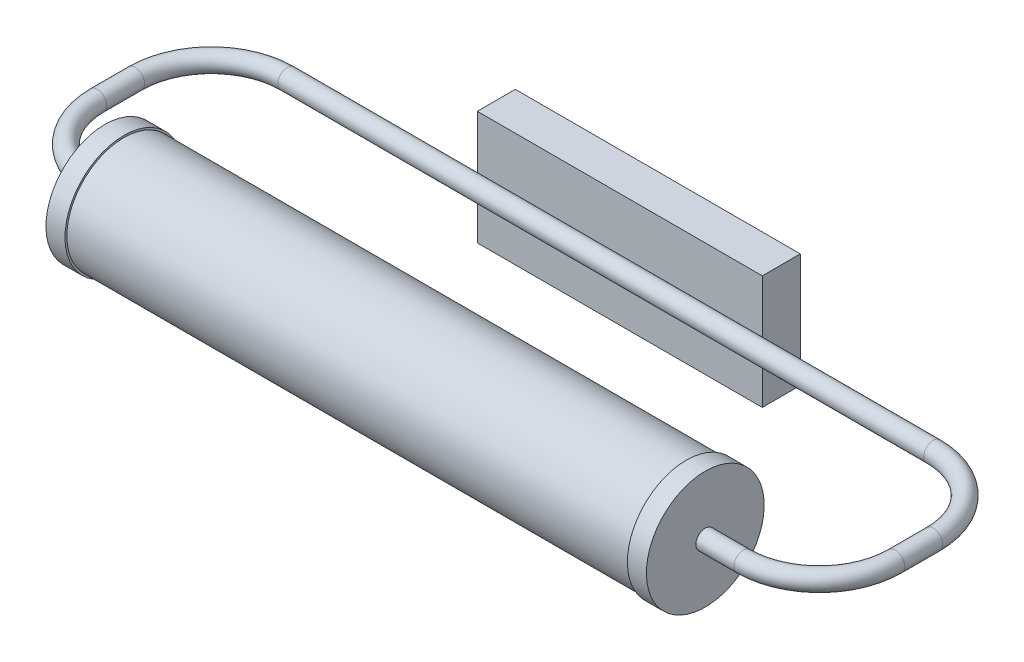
ISO-10303-21;
HEADER;
FILE_DESCRIPTION(('STEP AP214'),'2;1');
FILE_NAME('part.step','',(''),(''),'','','');
FILE_SCHEMA(('AUTOMOTIVE_DESIGN { 1 0 10303 214 1 1 1 1 }'));
ENDSEC;
DATA;
#1=APPLICATION_CONTEXT('core data for automotive mechanical design processes');
#2=APPLICATION_PROTOCOL_DEFINITION('international standard','automotive_design',2000,#1);
#3=PRODUCT_CONTEXT('',#1,'mechanical');
#4=PRODUCT('Part','Part','',(#3));
#5=PRODUCT_RELATED_PRODUCT_CATEGORY('part','',(#4));
#6=PRODUCT_DEFINITION_FORMATION('','',#4);
#7=PRODUCT_DEFINITION_CONTEXT('part definition',#1,'design');
#8=PRODUCT_DEFINITION('design','',#6,#7);
#9=PRODUCT_DEFINITION_SHAPE('','',#8);
#10=(LENGTH_UNIT() NAMED_UNIT(*) SI_UNIT(.MILLI.,.METRE.));
#11=(NAMED_UNIT(*) PLANE_ANGLE_UNIT() SI_UNIT($,.RADIAN.));
#12=(NAMED_UNIT(*) SI_UNIT($,.STERADIAN.) SOLID_ANGLE_UNIT());
#13=UNCERTAINTY_MEASURE_WITH_UNIT(LENGTH_MEASURE(1.E-05),#10,'distance_accuracy_value','');
#14=(GEOMETRIC_REPRESENTATION_CONTEXT(3) GLOBAL_UNCERTAINTY_ASSIGNED_CONTEXT((#13)) GLOBAL_UNIT_ASSIGNED_CONTEXT((#10,
#11,#12)) REPRESENTATION_CONTEXT('',''));
#15=CARTESIAN_POINT('',(0.,0.,0.));
#16=DIRECTION('',(0.,0.,1.));
#17=DIRECTION('',(1.,0.,0.));
#18=AXIS2_PLACEMENT_3D('',#15,#16,#17);
#19=CARTESIAN_POINT('',(-31.,30.,-125.));
#20=DIRECTION('',(1.,0.,0.));
#21=DIRECTION('',(0.,0.,-1.));
#22=AXIS2_PLACEMENT_3D('',#19,#20,#21);
#23=PLANE('',#22);
#24=DIRECTION('',(0.,1.,0.));
#25=VECTOR('',#24,1.);
#26=CARTESIAN_POINT('',(-31.,30.,-105.));
#27=LINE('',#26,#25);
#28=CARTESIAN_POINT('',(-31.,-30.,-105.));
#29=VERTEX_POINT('',#28);
#30=CARTESIAN_POINT('',(-31.,30.,-105.));
#31=VERTEX_POINT('',#30);
#32=EDGE_CURVE('E183',#29,#31,#27,.T.);
#33=ORIENTED_EDGE('',*,*,#32,.T.);
#34=DIRECTION('',(0.,0.,1.));
#35=VECTOR('',#34,1.);
#36=CARTESIAN_POINT('',(-31.,30.,-125.));
#37=LINE('',#36,#35);
#38=CARTESIAN_POINT('',(-31.,30.,-125.));
#39=VERTEX_POINT('',#38);
#40=EDGE_CURVE('E13',#39,#31,#37,.T.);
#41=ORIENTED_EDGE('',*,*,#40,.F.);
#42=DIRECTION('',(0.,1.,0.));
#43=VECTOR('',#42,1.);
#44=CARTESIAN_POINT('',(-31.,30.,-125.));
#45=LINE('',#44,#43);
#46=CARTESIAN_POINT('',(-31.,-30.,-125.));
#47=VERTEX_POINT('',#46);
#48=EDGE_CURVE('E176',#47,#39,#45,.T.);
#49=ORIENTED_EDGE('',*,*,#48,.F.);
#50=DIRECTION('',(0.,0.,1.));
#51=VECTOR('',#50,1.);
#52=CARTESIAN_POINT('',(-31.,-30.,-125.));
#53=LINE('',#52,#51);
#54=EDGE_CURVE('E182',#47,#29,#53,.T.);
#55=ORIENTED_EDGE('',*,*,#54,.T.);
#56=EDGE_LOOP('',(#33,#41,#49,#55));
#57=FACE_BOUND('',#56,.T.);
#58=ADVANCED_FACE('F69',(#57),#23,.F.);
#59=CARTESIAN_POINT('',(119.,30.,-125.));
#60=DIRECTION('',(0.,-1.,0.));
#61=DIRECTION('',(0.,0.,-1.));
#62=AXIS2_PLACEMENT_3D('',#59,#60,#61);
#63=PLANE('',#62);
#64=DIRECTION('',(1.,0.,0.));
#65=VECTOR('',#64,1.);
#66=CARTESIAN_POINT('',(119.,30.,-105.));
#67=LINE('',#66,#65);
#68=CARTESIAN_POINT('',(119.,30.,-105.));
#69=VERTEX_POINT('',#68);
#70=EDGE_CURVE('E186',#31,#69,#67,.T.);
#71=ORIENTED_EDGE('',*,*,#70,.T.);
#72=DIRECTION('',(0.,0.,1.));
#73=VECTOR('',#72,1.);
#74=CARTESIAN_POINT('',(119.,30.,-125.));
#75=LINE('',#74,#73);
#76=CARTESIAN_POINT('',(119.,30.,-125.));
#77=VERTEX_POINT('',#76);
#78=EDGE_CURVE('E76',#77,#69,#75,.T.);
#79=ORIENTED_EDGE('',*,*,#78,.F.);
#80=DIRECTION('',(1.,0.,0.));
#81=VECTOR('',#80,1.);
#82=CARTESIAN_POINT('',(119.,30.,-125.));
#83=LINE('',#82,#81);
#84=EDGE_CURVE('E120',#39,#77,#83,.T.);
#85=ORIENTED_EDGE('',*,*,#84,.F.);
#86=ORIENTED_EDGE('',*,*,#40,.T.);
#87=EDGE_LOOP('',(#71,#79,#85,#86));
#88=FACE_BOUND('',#87,.T.);
#89=ADVANCED_FACE('F215',(#88),#63,.F.);
#90=CARTESIAN_POINT('',(119.,30.,-125.));
#91=DIRECTION('',(-1.,0.,0.));
#92=DIRECTION('',(0.,-1.,0.));
#93=AXIS2_PLACEMENT_3D('',#90,#91,#92);
#94=PLANE('',#93);
#95=DIRECTION('',(0.,-1.,0.));
#96=VECTOR('',#95,1.);
#97=CARTESIAN_POINT('',(119.,30.,-105.));
#98=LINE('',#97,#96);
#99=CARTESIAN_POINT('',(119.,-30.,-105.));
#100=VERTEX_POINT('',#99);
#101=EDGE_CURVE('E188',#69,#100,#98,.T.);
#102=ORIENTED_EDGE('',*,*,#101,.T.);
#103=DIRECTION('',(0.,0.,1.));
#104=VECTOR('',#103,1.);
#105=CARTESIAN_POINT('',(119.,-30.,-125.));
#106=LINE('',#105,#104);
#107=CARTESIAN_POINT('',(119.,-30.,-125.));
#108=VERTEX_POINT('',#107);
#109=EDGE_CURVE('E192',#108,#100,#106,.T.);
#110=ORIENTED_EDGE('',*,*,#109,.F.);
#111=DIRECTION('',(0.,-1.,0.));
#112=VECTOR('',#111,1.);
#113=CARTESIAN_POINT('',(119.,30.,-125.));
#114=LINE('',#113,#112);
#115=EDGE_CURVE('E179',#77,#108,#114,.T.);
#116=ORIENTED_EDGE('',*,*,#115,.F.);
#117=ORIENTED_EDGE('',*,*,#78,.T.);
#118=EDGE_LOOP('',(#102,#110,#116,#117));
#119=FACE_BOUND('',#118,.T.);
#120=ADVANCED_FACE('F197',(#119),#94,.F.);
#121=CARTESIAN_POINT('',(119.,-30.,-125.));
#122=DIRECTION('',(0.,1.,0.));
#123=DIRECTION('',(0.,0.,1.));
#124=AXIS2_PLACEMENT_3D('',#121,#122,#123);
#125=PLANE('',#124);
#126=DIRECTION('',(-1.,0.,0.));
#127=VECTOR('',#126,1.);
#128=CARTESIAN_POINT('',(119.,-30.,-105.));
#129=LINE('',#128,#127);
#130=EDGE_CURVE('E113',#100,#29,#129,.T.);
#131=ORIENTED_EDGE('',*,*,#130,.T.);
#132=ORIENTED_EDGE('',*,*,#54,.F.);
#133=DIRECTION('',(-1.,0.,0.));
#134=VECTOR('',#133,1.);
#135=CARTESIAN_POINT('',(119.,-30.,-125.));
#136=LINE('',#135,#134);
#137=EDGE_CURVE('E92',#108,#47,#136,.T.);
#138=ORIENTED_EDGE('',*,*,#137,.F.);
#139=ORIENTED_EDGE('',*,*,#109,.T.);
#140=EDGE_LOOP('',(#131,#132,#138,#139));
#141=FACE_BOUND('',#140,.T.);
#142=ADVANCED_FACE('F205',(#141),#125,.F.);
#143=CARTESIAN_POINT('',(0.,0.,-125.));
#144=DIRECTION('',(0.,0.,-1.));
#145=DIRECTION('',(-1.,0.,0.));
#146=AXIS2_PLACEMENT_3D('',#143,#144,#145);
#147=PLANE('',#146);
#148=DIRECTION('',(0.,1.,0.));
#149=VECTOR('',#148,1.);
#150=CARTESIAN_POINT('',(-30.,30.,-125.));
#151=LINE('',#150,#149);
#152=CARTESIAN_POINT('',(-30.,-29.,-125.));
#153=VERTEX_POINT('',#152);
#154=CARTESIAN_POINT('',(-30.,29.,-125.));
#155=VERTEX_POINT('',#154);
#156=EDGE_CURVE('E165',#153,#155,#151,.T.);
#157=ORIENTED_EDGE('',*,*,#156,.F.);
#158=DIRECTION('',(-1.,0.,0.));
#159=VECTOR('',#158,1.);
#160=CARTESIAN_POINT('',(119.,-29.,-125.));
#161=LINE('',#160,#159);
#162=CARTESIAN_POINT('',(118.,-29.,-125.));
#163=VERTEX_POINT('',#162);
#164=EDGE_CURVE('E174',#163,#153,#161,.T.);
#165=ORIENTED_EDGE('',*,*,#164,.F.);
#166=DIRECTION('',(0.,-1.,0.));
#167=VECTOR('',#166,1.);
#168=CARTESIAN_POINT('',(118.,30.,-125.));
#169=LINE('',#168,#167);
#170=CARTESIAN_POINT('',(118.,29.,-125.));
#171=VERTEX_POINT('',#170);
#172=EDGE_CURVE('E172',#171,#163,#169,.T.);
#173=ORIENTED_EDGE('',*,*,#172,.F.);
#174=DIRECTION('',(1.,0.,0.));
#175=VECTOR('',#174,1.);
#176=CARTESIAN_POINT('',(119.,29.,-125.));
#177=LINE('',#176,#175);
#178=EDGE_CURVE('E157',#155,#171,#177,.T.);
#179=ORIENTED_EDGE('',*,*,#178,.F.);
#180=EDGE_LOOP('',(#157,#165,#173,#179));
#181=FACE_BOUND('',#180,.T.);
#182=ORIENTED_EDGE('',*,*,#48,.T.);
#183=ORIENTED_EDGE('',*,*,#84,.T.);
#184=ORIENTED_EDGE('',*,*,#115,.T.);
#185=ORIENTED_EDGE('',*,*,#137,.T.);
#186=EDGE_LOOP('',(#182,#183,#184,#185));
#187=FACE_BOUND('',#186,.T.);
#188=ADVANCED_FACE('F207',(#181,#187),#147,.T.);
#189=CARTESIAN_POINT('',(0.,0.,-105.));
#190=DIRECTION('',(0.,0.,-1.));
#191=DIRECTION('',(-1.,0.,0.));
#192=AXIS2_PLACEMENT_3D('',#189,#190,#191);
#193=PLANE('',#192);
#194=ORIENTED_EDGE('',*,*,#32,.F.);
#195=ORIENTED_EDGE('',*,*,#130,.F.);
#196=ORIENTED_EDGE('',*,*,#101,.F.);
#197=ORIENTED_EDGE('',*,*,#70,.F.);
#198=EDGE_LOOP('',(#194,#195,#196,#197));
#199=FACE_BOUND('',#198,.T.);
#200=ADVANCED_FACE('F201',(#199),#193,.F.);
#201=CARTESIAN_POINT('',(-30.,30.,-125.));
#202=DIRECTION('',(1.,0.,0.));
#203=DIRECTION('',(0.,0.,-1.));
#204=AXIS2_PLACEMENT_3D('',#201,#202,#203);
#205=PLANE('',#204);
#206=DIRECTION('',(0.,1.,0.));
#207=VECTOR('',#206,1.);
#208=CARTESIAN_POINT('',(-30.,30.,-106.));
#209=LINE('',#208,#207);
#210=CARTESIAN_POINT('',(-30.,-29.,-106.));
#211=VERTEX_POINT('',#210);
#212=CARTESIAN_POINT('',(-30.,29.,-106.));
#213=VERTEX_POINT('',#212);
#214=EDGE_CURVE('E148',#211,#213,#209,.T.);
#215=ORIENTED_EDGE('',*,*,#214,.F.);
#216=DIRECTION('',(0.,0.,1.));
#217=VECTOR('',#216,1.);
#218=CARTESIAN_POINT('',(-30.,-29.,-125.));
#219=LINE('',#218,#217);
#220=EDGE_CURVE('E168',#153,#211,#219,.T.);
#221=ORIENTED_EDGE('',*,*,#220,.F.);
#222=ORIENTED_EDGE('',*,*,#156,.T.);
#223=DIRECTION('',(0.,0.,1.));
#224=VECTOR('',#223,1.);
#225=CARTESIAN_POINT('',(-30.,29.,-125.));
#226=LINE('',#225,#224);
#227=EDGE_CURVE('E160',#155,#213,#226,.T.);
#228=ORIENTED_EDGE('',*,*,#227,.T.);
#229=EDGE_LOOP('',(#215,#221,#222,#228));
#230=FACE_BOUND('',#229,.T.);
#231=ADVANCED_FACE('F242',(#230),#205,.T.);
#232=CARTESIAN_POINT('',(119.,29.,-125.));
#233=DIRECTION('',(0.,-1.,0.));
#234=DIRECTION('',(0.,0.,-1.));
#235=AXIS2_PLACEMENT_3D('',#232,#233,#234);
#236=PLANE('',#235);
#237=DIRECTION('',(1.,0.,0.));
#238=VECTOR('',#237,1.);
#239=CARTESIAN_POINT('',(119.,29.,-106.));
#240=LINE('',#239,#238);
#241=CARTESIAN_POINT('',(118.,29.,-106.));
#242=VERTEX_POINT('',#241);
#243=EDGE_CURVE('E142',#213,#242,#240,.T.);
#244=ORIENTED_EDGE('',*,*,#243,.F.);
#245=ORIENTED_EDGE('',*,*,#227,.F.);
#246=ORIENTED_EDGE('',*,*,#178,.T.);
#247=DIRECTION('',(0.,0.,1.));
#248=VECTOR('',#247,1.);
#249=CARTESIAN_POINT('',(118.,29.,-125.));
#250=LINE('',#249,#248);
#251=EDGE_CURVE('E154',#171,#242,#250,.T.);
#252=ORIENTED_EDGE('',*,*,#251,.T.);
#253=EDGE_LOOP('',(#244,#245,#246,#252));
#254=FACE_BOUND('',#253,.T.);
#255=ADVANCED_FACE('F155',(#254),#236,.T.);
#256=CARTESIAN_POINT('',(118.,30.,-125.));
#257=DIRECTION('',(-1.,0.,0.));
#258=DIRECTION('',(0.,-1.,0.));
#259=AXIS2_PLACEMENT_3D('',#256,#257,#258);
#260=PLANE('',#259);
#261=DIRECTION('',(0.,-1.,0.));
#262=VECTOR('',#261,1.);
#263=CARTESIAN_POINT('',(118.,30.,-106.));
#264=LINE('',#263,#262);
#265=CARTESIAN_POINT('',(118.,-29.,-106.));
#266=VERTEX_POINT('',#265);
#267=EDGE_CURVE('E146',#242,#266,#264,.T.);
#268=ORIENTED_EDGE('',*,*,#267,.F.);
#269=ORIENTED_EDGE('',*,*,#251,.F.);
#270=ORIENTED_EDGE('',*,*,#172,.T.);
#271=DIRECTION('',(0.,0.,1.));
#272=VECTOR('',#271,1.);
#273=CARTESIAN_POINT('',(118.,-29.,-125.));
#274=LINE('',#273,#272);
#275=EDGE_CURVE('E83',#163,#266,#274,.T.);
#276=ORIENTED_EDGE('',*,*,#275,.T.);
#277=EDGE_LOOP('',(#268,#269,#270,#276));
#278=FACE_BOUND('',#277,.T.);
#279=ADVANCED_FACE('F162',(#278),#260,.T.);
#280=CARTESIAN_POINT('',(119.,-29.,-125.));
#281=DIRECTION('',(0.,1.,0.));
#282=DIRECTION('',(0.,0.,1.));
#283=AXIS2_PLACEMENT_3D('',#280,#281,#282);
#284=PLANE('',#283);
#285=DIRECTION('',(-1.,0.,0.));
#286=VECTOR('',#285,1.);
#287=CARTESIAN_POINT('',(119.,-29.,-106.));
#288=LINE('',#287,#286);
#289=EDGE_CURVE('E163',#266,#211,#288,.T.);
#290=ORIENTED_EDGE('',*,*,#289,.F.);
#291=ORIENTED_EDGE('',*,*,#275,.F.);
#292=ORIENTED_EDGE('',*,*,#164,.T.);
#293=ORIENTED_EDGE('',*,*,#220,.T.);
#294=EDGE_LOOP('',(#290,#291,#292,#293));
#295=FACE_BOUND('',#294,.T.);
#296=ADVANCED_FACE('F272',(#295),#284,.T.);
#297=CARTESIAN_POINT('',(0.,0.,-106.));
#298=DIRECTION('',(0.,0.,-1.));
#299=DIRECTION('',(-1.,0.,0.));
#300=AXIS2_PLACEMENT_3D('',#297,#298,#299);
#301=PLANE('',#300);
#302=ORIENTED_EDGE('',*,*,#214,.T.);
#303=ORIENTED_EDGE('',*,*,#243,.T.);
#304=ORIENTED_EDGE('',*,*,#267,.T.);
#305=ORIENTED_EDGE('',*,*,#289,.T.);
#306=EDGE_LOOP('',(#302,#303,#304,#305));
#307=FACE_BOUND('',#306,.T.);
#308=ADVANCED_FACE('F144',(#307),#301,.T.);
#309=CLOSED_SHELL('',(#58,#89,#120,#142,#188,#200,#231,#255,#279,#296,#308));
#310=MANIFOLD_SOLID_BREP('B2',#309);
#311=CARTESIAN_POINT('',(194.,0.,0.));
#312=DIRECTION('',(-1.,0.,0.));
#313=DIRECTION('',(0.,0.,1.));
#314=AXIS2_PLACEMENT_3D('',#311,#312,#313);
#315=PLANE('',#314);
#316=CARTESIAN_POINT('',(194.,0.,0.));
#317=DIRECTION('',(-1.,0.,0.));
#318=DIRECTION('',(0.,0.,1.));
#319=AXIS2_PLACEMENT_3D('',#316,#317,#318);
#320=CIRCLE('',#319,5.);
#321=CARTESIAN_POINT('',(194.,0.,5.));
#322=VERTEX_POINT('',#321);
#323=EDGE_CURVE('E327',#322,#322,#320,.T.);
#324=ORIENTED_EDGE('',*,*,#323,.T.);
#325=EDGE_LOOP('',(#324));
#326=FACE_BOUND('',#325,.T.);
#327=ADVANCED_FACE('F315',(#326),#315,.T.);
#328=CARTESIAN_POINT('',(-122.,0.,0.));
#329=DIRECTION('',(-1.,0.,0.));
#330=DIRECTION('',(0.,0.,1.));
#331=AXIS2_PLACEMENT_3D('',#328,#329,#330);
#332=PLANE('',#331);
#333=CARTESIAN_POINT('',(-122.,0.,0.));
#334=DIRECTION('',(-1.,0.,0.));
#335=DIRECTION('',(0.,0.,1.));
#336=AXIS2_PLACEMENT_3D('',#333,#334,#335);
#337=CIRCLE('',#336,5.);
#338=CARTESIAN_POINT('',(-122.,0.,5.));
#339=VERTEX_POINT('',#338);
#340=EDGE_CURVE('E67',#339,#339,#337,.T.);
#341=ORIENTED_EDGE('',*,*,#340,.F.);
#342=EDGE_LOOP('',(#341));
#343=FACE_BOUND('',#342,.T.);
#344=ADVANCED_FACE('F333',(#343),#332,.F.);
#345=CARTESIAN_POINT('',(194.,0.,0.));
#346=DIRECTION('',(1.,0.,0.));
#347=DIRECTION('',(0.,0.,-1.));
#348=AXIS2_PLACEMENT_3D('',#345,#346,#347);
#349=CYLINDRICAL_SURFACE('',#348,5.);
#350=CARTESIAN_POINT('',(214.,0.,0.));
#351=DIRECTION('',(-1.,0.,0.));
#352=DIRECTION('',(0.,0.,1.));
#353=AXIS2_PLACEMENT_3D('',#350,#351,#352);
#354=CIRCLE('',#353,5.);
#355=CARTESIAN_POINT('',(214.,0.,5.));
#356=VERTEX_POINT('',#355);
#357=EDGE_CURVE('E383',#356,#356,#354,.T.);
#358=ORIENTED_EDGE('',*,*,#357,.T.);
#359=EDGE_LOOP('',(#358));
#360=FACE_BOUND('',#359,.T.);
#361=ORIENTED_EDGE('',*,*,#323,.F.);
#362=EDGE_LOOP('',(#361));
#363=FACE_BOUND('',#362,.T.);
#364=ADVANCED_FACE('F335',(#360,#363),#349,.T.);
#365=CARTESIAN_POINT('',(214.,0.,-40.));
#366=DIRECTION('',(0.,1.,0.));
#367=DIRECTION('',(0.,0.,1.));
#368=AXIS2_PLACEMENT_3D('',#365,#366,#367);
#369=TOROIDAL_SURFACE('',#368,40.,5.);
#370=CARTESIAN_POINT('',(254.,0.,-40.));
#371=DIRECTION('',(0.,0.,1.));
#372=DIRECTION('',(1.,0.,0.));
#373=AXIS2_PLACEMENT_3D('',#370,#371,#372);
#374=CIRCLE('',#373,5.);
#375=CARTESIAN_POINT('',(259.,0.,-40.));
#376=VERTEX_POINT('',#375);
#377=EDGE_CURVE('E380',#376,#376,#374,.T.);
#378=CARTESIAN_POINT('',(214.,0.,-40.));
#379=DIRECTION('',(0.,1.,0.));
#380=DIRECTION('',(0.,0.,1.));
#381=AXIS2_PLACEMENT_3D('',#378,#379,#380);
#382=CIRCLE('',#381,45.);
#383=EDGE_CURVE('',#356,#376,#382,.T.);
#384=ORIENTED_EDGE('',*,*,#357,.F.);
#385=ORIENTED_EDGE('',*,*,#377,.T.);
#386=ORIENTED_EDGE('',*,*,#383,.T.);
#387=ORIENTED_EDGE('',*,*,#383,.F.);
#388=EDGE_LOOP('',(#384,#386,#385,#387));
#389=FACE_BOUND('',#388,.T.);
#390=ADVANCED_FACE('F340',(#389),#369,.T.);
#391=CARTESIAN_POINT('',(254.,0.,-40.));
#392=DIRECTION('',(0.,0.,-1.));
#393=DIRECTION('',(-1.,0.,0.));
#394=AXIS2_PLACEMENT_3D('',#391,#392,#393);
#395=CYLINDRICAL_SURFACE('',#394,5.);
#396=CARTESIAN_POINT('',(254.,0.,-60.));
#397=DIRECTION('',(0.,0.,1.));
#398=DIRECTION('',(1.,0.,0.));
#399=AXIS2_PLACEMENT_3D('',#396,#397,#398);
#400=CIRCLE('',#399,5.);
#401=CARTESIAN_POINT('',(259.,0.,-60.));
#402=VERTEX_POINT('',#401);
#403=EDGE_CURVE('E385',#402,#402,#400,.T.);
#404=ORIENTED_EDGE('',*,*,#403,.T.);
#405=EDGE_LOOP('',(#404));
#406=FACE_BOUND('',#405,.T.);
#407=ORIENTED_EDGE('',*,*,#377,.F.);
#408=EDGE_LOOP('',(#407));
#409=FACE_BOUND('',#408,.T.);
#410=ADVANCED_FACE('F368',(#406,#409),#395,.T.);
#411=CARTESIAN_POINT('',(214.,0.,-60.));
#412=DIRECTION('',(0.,1.,0.));
#413=DIRECTION('',(0.,0.,1.));
#414=AXIS2_PLACEMENT_3D('',#411,#412,#413);
#415=TOROIDAL_SURFACE('',#414,40.,5.);
#416=CARTESIAN_POINT('',(214.,0.,-100.));
#417=DIRECTION('',(1.,0.,0.));
#418=DIRECTION('',(0.,0.,-1.));
#419=AXIS2_PLACEMENT_3D('',#416,#417,#418);
#420=CIRCLE('',#419,5.);
#421=CARTESIAN_POINT('',(214.,0.,-105.));
#422=VERTEX_POINT('',#421);
#423=EDGE_CURVE('E391',#422,#422,#420,.T.);
#424=CARTESIAN_POINT('',(214.,0.,-60.));
#425=DIRECTION('',(0.,1.,0.));
#426=DIRECTION('',(0.,0.,1.));
#427=AXIS2_PLACEMENT_3D('',#424,#425,#426);
#428=CIRCLE('',#427,45.);
#429=EDGE_CURVE('',#402,#422,#428,.T.);
#430=ORIENTED_EDGE('',*,*,#403,.F.);
#431=ORIENTED_EDGE('',*,*,#423,.T.);
#432=ORIENTED_EDGE('',*,*,#429,.T.);
#433=ORIENTED_EDGE('',*,*,#429,.F.);
#434=EDGE_LOOP('',(#430,#432,#431,#433));
#435=FACE_BOUND('',#434,.T.);
#436=ADVANCED_FACE('F364',(#435),#415,.T.);
#437=CARTESIAN_POINT('',(214.,0.,-100.));
#438=DIRECTION('',(-1.,0.,0.));
#439=DIRECTION('',(0.,0.,1.));
#440=AXIS2_PLACEMENT_3D('',#437,#438,#439);
#441=CYLINDRICAL_SURFACE('',#440,5.);
#442=CARTESIAN_POINT('',(-126.,0.,-100.));
#443=DIRECTION('',(1.,0.,0.));
#444=DIRECTION('',(0.,0.,-1.));
#445=AXIS2_PLACEMENT_3D('',#442,#443,#444);
#446=CIRCLE('',#445,5.);
#447=CARTESIAN_POINT('',(-126.,0.,-105.));
#448=VERTEX_POINT('',#447);
#449=EDGE_CURVE('E394',#448,#448,#446,.T.);
#450=ORIENTED_EDGE('',*,*,#449,.T.);
#451=EDGE_LOOP('',(#450));
#452=FACE_BOUND('',#451,.T.);
#453=ORIENTED_EDGE('',*,*,#423,.F.);
#454=EDGE_LOOP('',(#453));
#455=FACE_BOUND('',#454,.T.);
#456=ADVANCED_FACE('F360',(#452,#455),#441,.T.);
#457=CARTESIAN_POINT('',(-126.,0.,-60.));
#458=DIRECTION('',(0.,1.,0.));
#459=DIRECTION('',(0.,0.,1.));
#460=AXIS2_PLACEMENT_3D('',#457,#458,#459);
#461=TOROIDAL_SURFACE('',#460,40.,5.);
#462=CARTESIAN_POINT('',(-166.,0.,-60.));
#463=DIRECTION('',(0.,0.,-1.));
#464=DIRECTION('',(-1.,0.,0.));
#465=AXIS2_PLACEMENT_3D('',#462,#463,#464);
#466=CIRCLE('',#465,5.);
#467=CARTESIAN_POINT('',(-171.,0.,-60.));
#468=VERTEX_POINT('',#467);
#469=EDGE_CURVE('E397',#468,#468,#466,.T.);
#470=CARTESIAN_POINT('',(-126.,0.,-60.));
#471=DIRECTION('',(0.,1.,0.));
#472=DIRECTION('',(0.,0.,1.));
#473=AXIS2_PLACEMENT_3D('',#470,#471,#472);
#474=CIRCLE('',#473,45.);
#475=EDGE_CURVE('',#448,#468,#474,.T.);
#476=ORIENTED_EDGE('',*,*,#449,.F.);
#477=ORIENTED_EDGE('',*,*,#469,.T.);
#478=ORIENTED_EDGE('',*,*,#475,.T.);
#479=ORIENTED_EDGE('',*,*,#475,.F.);
#480=EDGE_LOOP('',(#476,#478,#477,#479));
#481=FACE_BOUND('',#480,.T.);
#482=ADVANCED_FACE('F356',(#481),#461,.T.);
#483=CARTESIAN_POINT('',(-166.,0.,-60.));
#484=DIRECTION('',(0.,0.,1.));
#485=DIRECTION('',(1.,0.,0.));
#486=AXIS2_PLACEMENT_3D('',#483,#484,#485);
#487=CYLINDRICAL_SURFACE('',#486,5.);
#488=CARTESIAN_POINT('',(-166.,0.,-40.));
#489=DIRECTION('',(0.,0.,-1.));
#490=DIRECTION('',(-1.,0.,0.));
#491=AXIS2_PLACEMENT_3D('',#488,#489,#490);
#492=CIRCLE('',#491,5.);
#493=CARTESIAN_POINT('',(-171.,0.,-40.));
#494=VERTEX_POINT('',#493);
#495=EDGE_CURVE('E400',#494,#494,#492,.T.);
#496=ORIENTED_EDGE('',*,*,#495,.T.);
#497=EDGE_LOOP('',(#496));
#498=FACE_BOUND('',#497,.T.);
#499=ORIENTED_EDGE('',*,*,#469,.F.);
#500=EDGE_LOOP('',(#499));
#501=FACE_BOUND('',#500,.T.);
#502=ADVANCED_FACE('F350',(#498,#501),#487,.T.);
#503=CARTESIAN_POINT('',(-126.,0.,-40.));
#504=DIRECTION('',(0.,1.,0.));
#505=DIRECTION('',(0.,0.,1.));
#506=AXIS2_PLACEMENT_3D('',#503,#504,#505);
#507=TOROIDAL_SURFACE('',#506,40.,5.);
#508=CARTESIAN_POINT('',(-126.,0.,0.));
#509=DIRECTION('',(-1.,0.,0.));
#510=DIRECTION('',(0.,0.,1.));
#511=AXIS2_PLACEMENT_3D('',#508,#509,#510);
#512=CIRCLE('',#511,5.);
#513=CARTESIAN_POINT('',(-126.,0.,5.));
#514=VERTEX_POINT('',#513);
#515=EDGE_CURVE('E322',#514,#514,#512,.T.);
#516=CARTESIAN_POINT('',(-126.,0.,-40.));
#517=DIRECTION('',(0.,1.,0.));
#518=DIRECTION('',(0.,0.,1.));
#519=AXIS2_PLACEMENT_3D('',#516,#517,#518);
#520=CIRCLE('',#519,45.);
#521=EDGE_CURVE('',#494,#514,#520,.T.);
#522=ORIENTED_EDGE('',*,*,#495,.F.);
#523=ORIENTED_EDGE('',*,*,#515,.T.);
#524=ORIENTED_EDGE('',*,*,#521,.T.);
#525=ORIENTED_EDGE('',*,*,#521,.F.);
#526=EDGE_LOOP('',(#522,#524,#523,#525));
#527=FACE_BOUND('',#526,.T.);
#528=ADVANCED_FACE('F346',(#527),#507,.T.);
#529=CARTESIAN_POINT('',(-126.,0.,0.));
#530=DIRECTION('',(1.,0.,0.));
#531=DIRECTION('',(0.,0.,-1.));
#532=AXIS2_PLACEMENT_3D('',#529,#530,#531);
#533=CYLINDRICAL_SURFACE('',#532,5.);
#534=ORIENTED_EDGE('',*,*,#340,.T.);
#535=EDGE_LOOP('',(#534));
#536=FACE_BOUND('',#535,.T.);
#537=ORIENTED_EDGE('',*,*,#515,.F.);
#538=EDGE_LOOP('',(#537));
#539=FACE_BOUND('',#538,.T.);
#540=ADVANCED_FACE('F330',(#536,#539),#533,.T.);
#541=CLOSED_SHELL('',(#327,#344,#364,#390,#410,#436,#456,#482,#502,#528,#540));
#542=MANIFOLD_SOLID_BREP('B7',#541);
#543=CARTESIAN_POINT('',(184.,0.,0.));
#544=DIRECTION('',(1.,0.,0.));
#545=DIRECTION('',(0.,-1.,0.));
#546=AXIS2_PLACEMENT_3D('',#543,#544,#545);
#547=CYLINDRICAL_SURFACE('',#546,31.);
#548=CARTESIAN_POINT('',(184.,0.,0.));
#549=DIRECTION('',(1.,0.,0.));
#550=DIRECTION('',(0.,1.,0.));
#551=AXIS2_PLACEMENT_3D('',#548,#549,#550);
#552=CIRCLE('',#551,31.);
#553=CARTESIAN_POINT('',(184.,31.,0.));
#554=VERTEX_POINT('',#553);
#555=EDGE_CURVE('E314',#554,#554,#552,.T.);
#556=ORIENTED_EDGE('',*,*,#555,.T.);
#557=EDGE_LOOP('',(#556));
#558=FACE_BOUND('',#557,.T.);
#559=CARTESIAN_POINT('',(194.,0.,0.));
#560=DIRECTION('',(1.,0.,0.));
#561=DIRECTION('',(0.,1.,0.));
#562=AXIS2_PLACEMENT_3D('',#559,#560,#561);
#563=CIRCLE('',#562,31.);
#564=CARTESIAN_POINT('',(194.,31.,0.));
#565=VERTEX_POINT('',#564);
#566=EDGE_CURVE('E488',#565,#565,#563,.T.);
#567=ORIENTED_EDGE('',*,*,#566,.F.);
#568=EDGE_LOOP('',(#567));
#569=FACE_BOUND('',#568,.T.);
#570=ADVANCED_FACE('F485',(#558,#569),#547,.T.);
#571=CARTESIAN_POINT('',(184.,0.,0.));
#572=DIRECTION('',(-1.,0.,0.));
#573=DIRECTION('',(0.,1.,0.));
#574=AXIS2_PLACEMENT_3D('',#571,#572,#573);
#575=PLANE('',#574);
#576=CARTESIAN_POINT('',(184.,0.,0.));
#577=DIRECTION('',(1.,0.,0.));
#578=DIRECTION('',(0.,1.,0.));
#579=AXIS2_PLACEMENT_3D('',#576,#577,#578);
#580=CIRCLE('',#579,30.);
#581=CARTESIAN_POINT('',(184.,30.,0.));
#582=VERTEX_POINT('',#581);
#583=EDGE_CURVE('E497',#582,#582,#580,.T.);
#584=ORIENTED_EDGE('',*,*,#583,.T.);
#585=EDGE_LOOP('',(#584));
#586=FACE_BOUND('',#585,.T.);
#587=ORIENTED_EDGE('',*,*,#555,.F.);
#588=EDGE_LOOP('',(#587));
#589=FACE_BOUND('',#588,.T.);
#590=ADVANCED_FACE('F515',(#586,#589),#575,.T.);
#591=CARTESIAN_POINT('',(194.,0.,0.));
#592=DIRECTION('',(-1.,0.,0.));
#593=DIRECTION('',(0.,1.,0.));
#594=AXIS2_PLACEMENT_3D('',#591,#592,#593);
#595=PLANE('',#594);
#596=ORIENTED_EDGE('',*,*,#566,.T.);
#597=EDGE_LOOP('',(#596));
#598=FACE_BOUND('',#597,.T.);
#599=ADVANCED_FACE('F512',(#598),#595,.F.);
#600=CARTESIAN_POINT('',(186.,0.,0.));
#601=DIRECTION('',(-1.,0.,0.));
#602=DIRECTION('',(0.,1.,0.));
#603=AXIS2_PLACEMENT_3D('',#600,#601,#602);
#604=CYLINDRICAL_SURFACE('',#603,30.);
#605=CARTESIAN_POINT('',(186.,0.,0.));
#606=DIRECTION('',(1.,0.,0.));
#607=DIRECTION('',(0.,1.,0.));
#608=AXIS2_PLACEMENT_3D('',#605,#606,#607);
#609=CIRCLE('',#608,30.);
#610=CARTESIAN_POINT('',(186.,30.,0.));
#611=VERTEX_POINT('',#610);
#612=EDGE_CURVE('E495',#611,#611,#609,.T.);
#613=ORIENTED_EDGE('',*,*,#612,.T.);
#614=EDGE_LOOP('',(#613));
#615=FACE_BOUND('',#614,.T.);
#616=ORIENTED_EDGE('',*,*,#583,.F.);
#617=EDGE_LOOP('',(#616));
#618=FACE_BOUND('',#617,.T.);
#619=ADVANCED_FACE('F503',(#615,#618),#604,.F.);
#620=CARTESIAN_POINT('',(186.,0.,0.));
#621=DIRECTION('',(-1.,0.,0.));
#622=DIRECTION('',(0.,1.,0.));
#623=AXIS2_PLACEMENT_3D('',#620,#621,#622);
#624=PLANE('',#623);
#625=ORIENTED_EDGE('',*,*,#612,.F.);
#626=EDGE_LOOP('',(#625));
#627=FACE_BOUND('',#626,.T.);
#628=ADVANCED_FACE('F506',(#627),#624,.T.);
#629=CLOSED_SHELL('',(#570,#590,#599,#619,#628));
#630=MANIFOLD_SOLID_BREP('B61',#629);
#631=CARTESIAN_POINT('',(186.,0.,0.));
#632=DIRECTION('',(1.,0.,0.));
#633=DIRECTION('',(0.,1.,0.));
#634=AXIS2_PLACEMENT_3D('',#631,#632,#633);
#635=PLANE('',#634);
#636=CARTESIAN_POINT('',(186.,0.,0.));
#637=DIRECTION('',(1.,0.,0.));
#638=DIRECTION('',(0.,1.,0.));
#639=AXIS2_PLACEMENT_3D('',#636,#637,#638);
#640=CIRCLE('',#639,30.);
#641=CARTESIAN_POINT('',(186.,30.,0.));
#642=VERTEX_POINT('',#641);
#643=EDGE_CURVE('E484',#642,#642,#640,.T.);
#644=ORIENTED_EDGE('',*,*,#643,.T.);
#645=EDGE_LOOP('',(#644));
#646=FACE_BOUND('',#645,.T.);
#647=CARTESIAN_POINT('',(186.,0.,0.));
#648=DIRECTION('',(1.,0.,0.));
#649=DIRECTION('',(0.,1.,0.));
#650=AXIS2_PLACEMENT_3D('',#647,#648,#649);
#651=CIRCLE('',#650,27.);
#652=CARTESIAN_POINT('',(186.,27.,0.));
#653=VERTEX_POINT('',#652);
#654=EDGE_CURVE('E573',#653,#653,#651,.T.);
#655=ORIENTED_EDGE('',*,*,#654,.F.);
#656=EDGE_LOOP('',(#655));
#657=FACE_BOUND('',#656,.T.);
#658=ADVANCED_FACE('F562',(#646,#657),#635,.T.);
#659=CARTESIAN_POINT('',(-114.,0.,0.));
#660=DIRECTION('',(1.,0.,0.));
#661=DIRECTION('',(0.,1.,0.));
#662=AXIS2_PLACEMENT_3D('',#659,#660,#661);
#663=PLANE('',#662);
#664=CARTESIAN_POINT('',(-114.,0.,0.));
#665=DIRECTION('',(1.,0.,0.));
#666=DIRECTION('',(0.,1.,0.));
#667=AXIS2_PLACEMENT_3D('',#664,#665,#666);
#668=CIRCLE('',#667,30.);
#669=CARTESIAN_POINT('',(-114.,30.,0.));
#670=VERTEX_POINT('',#669);
#671=EDGE_CURVE('E566',#670,#670,#668,.T.);
#672=ORIENTED_EDGE('',*,*,#671,.F.);
#673=EDGE_LOOP('',(#672));
#674=FACE_BOUND('',#673,.T.);
#675=CARTESIAN_POINT('',(-114.,0.,0.));
#676=DIRECTION('',(1.,0.,0.));
#677=DIRECTION('',(0.,1.,0.));
#678=AXIS2_PLACEMENT_3D('',#675,#676,#677);
#679=CIRCLE('',#678,27.);
#680=CARTESIAN_POINT('',(-114.,27.,0.));
#681=VERTEX_POINT('',#680);
#682=EDGE_CURVE('E575',#681,#681,#679,.T.);
#683=ORIENTED_EDGE('',*,*,#682,.T.);
#684=EDGE_LOOP('',(#683));
#685=FACE_BOUND('',#684,.T.);
#686=ADVANCED_FACE('F585',(#674,#685),#663,.F.);
#687=CARTESIAN_POINT('',(186.,0.,0.));
#688=DIRECTION('',(-1.,0.,0.));
#689=DIRECTION('',(0.,-1.,0.));
#690=AXIS2_PLACEMENT_3D('',#687,#688,#689);
#691=CYLINDRICAL_SURFACE('',#690,30.);
#692=ORIENTED_EDGE('',*,*,#643,.F.);
#693=EDGE_LOOP('',(#692));
#694=FACE_BOUND('',#693,.T.);
#695=ORIENTED_EDGE('',*,*,#671,.T.);
#696=EDGE_LOOP('',(#695));
#697=FACE_BOUND('',#696,.T.);
#698=ADVANCED_FACE('F564',(#694,#697),#691,.T.);
#699=CARTESIAN_POINT('',(186.,0.,0.));
#700=DIRECTION('',(-1.,0.,0.));
#701=DIRECTION('',(0.,-1.,0.));
#702=AXIS2_PLACEMENT_3D('',#699,#700,#701);
#703=CYLINDRICAL_SURFACE('',#702,27.);
#704=ORIENTED_EDGE('',*,*,#654,.T.);
#705=EDGE_LOOP('',(#704));
#706=FACE_BOUND('',#705,.T.);
#707=ORIENTED_EDGE('',*,*,#682,.F.);
#708=EDGE_LOOP('',(#707));
#709=FACE_BOUND('',#708,.T.);
#710=ADVANCED_FACE('F581',(#706,#709),#703,.F.);
#711=CLOSED_SHELL('',(#658,#686,#698,#710));
#712=MANIFOLD_SOLID_BREP('B309',#711);
#713=CARTESIAN_POINT('',(-112.,0.,0.));
#714=DIRECTION('',(-1.,0.,0.));
#715=DIRECTION('',(0.,-1.,0.));
#716=AXIS2_PLACEMENT_3D('',#713,#714,#715);
#717=CYLINDRICAL_SURFACE('',#716,31.);
#718=CARTESIAN_POINT('',(-112.,0.,0.));
#719=DIRECTION('',(1.,0.,0.));
#720=DIRECTION('',(0.,1.,0.));
#721=AXIS2_PLACEMENT_3D('',#718,#719,#720);
#722=CIRCLE('',#721,31.);
#723=CARTESIAN_POINT('',(-112.,31.,0.));
#724=VERTEX_POINT('',#723);
#725=EDGE_CURVE('E561',#724,#724,#722,.T.);
#726=ORIENTED_EDGE('',*,*,#725,.F.);
#727=EDGE_LOOP('',(#726));
#728=FACE_BOUND('',#727,.T.);
#729=CARTESIAN_POINT('',(-122.,0.,0.));
#730=DIRECTION('',(1.,0.,0.));
#731=DIRECTION('',(0.,1.,0.));
#732=AXIS2_PLACEMENT_3D('',#729,#730,#731);
#733=CIRCLE('',#732,31.);
#734=CARTESIAN_POINT('',(-122.,31.,0.));
#735=VERTEX_POINT('',#734);
#736=EDGE_CURVE('E626',#735,#735,#733,.T.);
#737=ORIENTED_EDGE('',*,*,#736,.T.);
#738=EDGE_LOOP('',(#737));
#739=FACE_BOUND('',#738,.T.);
#740=ADVANCED_FACE('F623',(#728,#739),#717,.T.);
#741=CARTESIAN_POINT('',(-112.,0.,0.));
#742=DIRECTION('',(1.,0.,0.));
#743=DIRECTION('',(0.,1.,0.));
#744=AXIS2_PLACEMENT_3D('',#741,#742,#743);
#745=PLANE('',#744);
#746=CARTESIAN_POINT('',(-112.,0.,0.));
#747=DIRECTION('',(1.,0.,0.));
#748=DIRECTION('',(0.,1.,0.));
#749=AXIS2_PLACEMENT_3D('',#746,#747,#748);
#750=CIRCLE('',#749,30.);
#751=CARTESIAN_POINT('',(-112.,30.,0.));
#752=VERTEX_POINT('',#751);
#753=EDGE_CURVE('E635',#752,#752,#750,.T.);
#754=ORIENTED_EDGE('',*,*,#753,.F.);
#755=EDGE_LOOP('',(#754));
#756=FACE_BOUND('',#755,.T.);
#757=ORIENTED_EDGE('',*,*,#725,.T.);
#758=EDGE_LOOP('',(#757));
#759=FACE_BOUND('',#758,.T.);
#760=ADVANCED_FACE('F650',(#756,#759),#745,.T.);
#761=CARTESIAN_POINT('',(-122.,0.,0.));
#762=DIRECTION('',(1.,0.,0.));
#763=DIRECTION('',(0.,1.,0.));
#764=AXIS2_PLACEMENT_3D('',#761,#762,#763);
#765=PLANE('',#764);
#766=ORIENTED_EDGE('',*,*,#736,.F.);
#767=EDGE_LOOP('',(#766));
#768=FACE_BOUND('',#767,.T.);
#769=ADVANCED_FACE('F646',(#768),#765,.F.);
#770=CARTESIAN_POINT('',(-114.,0.,0.));
#771=DIRECTION('',(1.,0.,0.));
#772=DIRECTION('',(0.,1.,0.));
#773=AXIS2_PLACEMENT_3D('',#770,#771,#772);
#774=CYLINDRICAL_SURFACE('',#773,30.);
#775=CARTESIAN_POINT('',(-114.,0.,0.));
#776=DIRECTION('',(1.,0.,0.));
#777=DIRECTION('',(0.,1.,0.));
#778=AXIS2_PLACEMENT_3D('',#775,#776,#777);
#779=CIRCLE('',#778,30.);
#780=CARTESIAN_POINT('',(-114.,30.,0.));
#781=VERTEX_POINT('',#780);
#782=EDGE_CURVE('E633',#781,#781,#779,.T.);
#783=ORIENTED_EDGE('',*,*,#782,.F.);
#784=EDGE_LOOP('',(#783));
#785=FACE_BOUND('',#784,.T.);
#786=ORIENTED_EDGE('',*,*,#753,.T.);
#787=EDGE_LOOP('',(#786));
#788=FACE_BOUND('',#787,.T.);
#789=ADVANCED_FACE('F643',(#785,#788),#774,.F.);
#790=CARTESIAN_POINT('',(-114.,0.,0.));
#791=DIRECTION('',(1.,0.,0.));
#792=DIRECTION('',(0.,1.,0.));
#793=AXIS2_PLACEMENT_3D('',#790,#791,#792);
#794=PLANE('',#793);
#795=ORIENTED_EDGE('',*,*,#782,.T.);
#796=EDGE_LOOP('',(#795));
#797=FACE_BOUND('',#796,.T.);
#798=ADVANCED_FACE('F641',(#797),#794,.T.);
#799=CLOSED_SHELL('',(#740,#760,#769,#789,#798));
#800=MANIFOLD_SOLID_BREP('B479',#799);
#801=ADVANCED_BREP_SHAPE_REPRESENTATION('',(#18,#310,#542,#630,#712,#800),#14);
#802=SHAPE_DEFINITION_REPRESENTATION(#9,#801);
ENDSEC;
END-ISO-10303-21;
